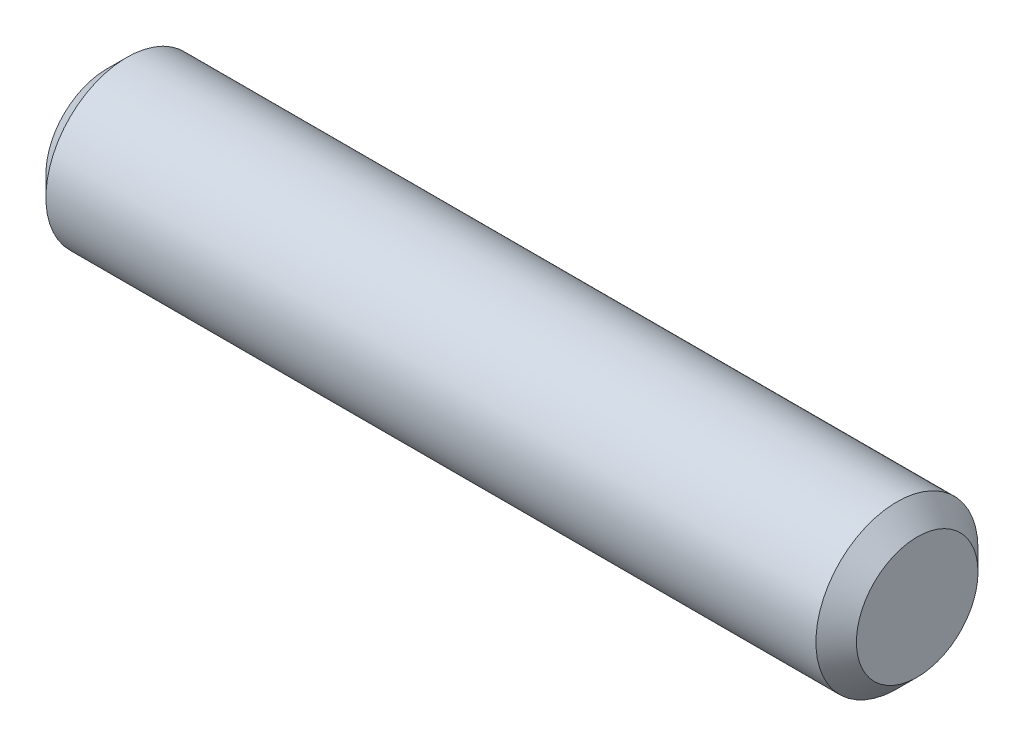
from build123d import *

# Parameters (mm, degrees)
SKETCH1_R      = 2
EXTRUDE1_DEPTH = 20
CHAMFER1_SIZE  = 0.5


with BuildPart() as part:
    # Sketch1 → Extrude1 (new body)
    with BuildSketch(Plane(origin=(0, 0, 0), x_dir=(0, 0, -1), z_dir=(1, 0, 0))):
        Circle(SKETCH1_R)
    extrude(amount=EXTRUDE1_DEPTH)

    # Chamfer1
    chamfer1_edges = [part.edges().sort_by_distance(p)[0] for p in [
        (0, 0, 2),
        (20, 0, 2),
    ]]
    chamfer(chamfer1_edges, length=CHAMFER1_SIZE)


solid = part.part
